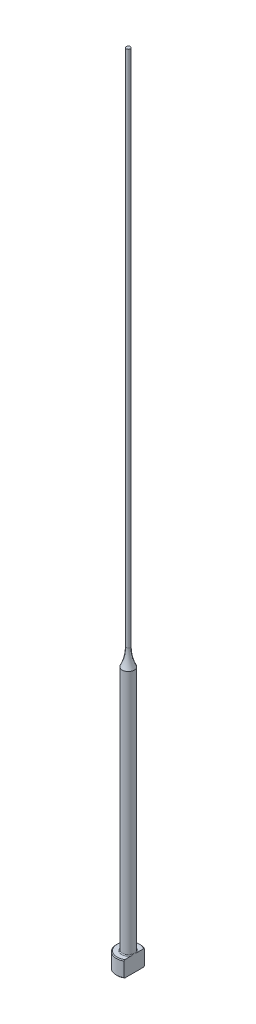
ISO-10303-21;
HEADER;
FILE_DESCRIPTION(('STEP AP214'),'2;1');
FILE_NAME('part.step','',(''),(''),'','','');
FILE_SCHEMA(('AUTOMOTIVE_DESIGN { 1 0 10303 214 1 1 1 1 }'));
ENDSEC;
DATA;
#1=APPLICATION_CONTEXT('core data for automotive mechanical design processes');
#2=APPLICATION_PROTOCOL_DEFINITION('international standard','automotive_design',2000,#1);
#3=PRODUCT_CONTEXT('',#1,'mechanical');
#4=PRODUCT('Part','Part','',(#3));
#5=PRODUCT_RELATED_PRODUCT_CATEGORY('part','',(#4));
#6=PRODUCT_DEFINITION_FORMATION('','',#4);
#7=PRODUCT_DEFINITION_CONTEXT('part definition',#1,'design');
#8=PRODUCT_DEFINITION('design','',#6,#7);
#9=PRODUCT_DEFINITION_SHAPE('','',#8);
#10=(LENGTH_UNIT() NAMED_UNIT(*) SI_UNIT(.MILLI.,.METRE.));
#11=(NAMED_UNIT(*) PLANE_ANGLE_UNIT() SI_UNIT($,.RADIAN.));
#12=(NAMED_UNIT(*) SI_UNIT($,.STERADIAN.) SOLID_ANGLE_UNIT());
#13=UNCERTAINTY_MEASURE_WITH_UNIT(LENGTH_MEASURE(1.E-05),#10,'distance_accuracy_value','');
#14=(GEOMETRIC_REPRESENTATION_CONTEXT(3) GLOBAL_UNCERTAINTY_ASSIGNED_CONTEXT((#13)) GLOBAL_UNIT_ASSIGNED_CONTEXT((#10,
#11,#12)) REPRESENTATION_CONTEXT('',''));
#15=CARTESIAN_POINT('',(0.,0.,0.));
#16=DIRECTION('',(0.,0.,1.));
#17=DIRECTION('',(1.,0.,0.));
#18=AXIS2_PLACEMENT_3D('',#15,#16,#17);
#19=CARTESIAN_POINT('',(-2.99999999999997,4.,0.));
#20=DIRECTION('',(0.,1.,0.));
#21=DIRECTION('',(0.,0.,1.));
#22=AXIS2_PLACEMENT_3D('',#19,#20,#21);
#23=PLANE('',#22);
#24=CARTESIAN_POINT('',(0.,4.,0.));
#25=DIRECTION('',(0.,1.,0.));
#26=DIRECTION('',(0.,0.,1.));
#27=AXIS2_PLACEMENT_3D('',#24,#25,#26);
#28=CIRCLE('',#27,2.79999999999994);
#29=CARTESIAN_POINT('',(1.49999999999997,4.,-2.36431808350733));
#30=VERTEX_POINT('',#29);
#31=CARTESIAN_POINT('',(1.49999999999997,4.,2.36431808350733));
#32=VERTEX_POINT('',#31);
#33=EDGE_CURVE('E187',#30,#32,#28,.T.);
#34=ORIENTED_EDGE('',*,*,#33,.T.);
#35=DIRECTION('',(0.,0.,-1.));
#36=VECTOR('',#35,1.);
#37=CARTESIAN_POINT('',(1.49999999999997,4.,0.));
#38=LINE('',#37,#36);
#39=CARTESIAN_POINT('',(1.49999999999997,3.99999999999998,0.799999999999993));
#40=VERTEX_POINT('',#39);
#41=EDGE_CURVE('E57',#32,#40,#38,.T.);
#42=ORIENTED_EDGE('',*,*,#41,.T.);
#43=CARTESIAN_POINT('',(0.,4.,0.));
#44=DIRECTION('',(0.,1.,0.));
#45=DIRECTION('',(0.,0.,1.));
#46=AXIS2_PLACEMENT_3D('',#43,#44,#45);
#47=CIRCLE('',#46,1.69999999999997);
#48=CARTESIAN_POINT('',(1.49999999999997,3.99999999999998,-0.799999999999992));
#49=VERTEX_POINT('',#48);
#50=EDGE_CURVE('E108',#40,#49,#47,.F.);
#51=ORIENTED_EDGE('',*,*,#50,.T.);
#52=EDGE_CURVE('E137',#49,#30,#38,.T.);
#53=ORIENTED_EDGE('',*,*,#52,.T.);
#54=EDGE_LOOP('',(#34,#42,#51,#53));
#55=FACE_BOUND('',#54,.T.);
#56=ADVANCED_FACE('F32',(#55),#23,.T.);
#57=CARTESIAN_POINT('',(0.,259.958771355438,0.));
#58=DIRECTION('',(0.,1.,0.));
#59=DIRECTION('',(0.,0.,1.));
#60=AXIS2_PLACEMENT_3D('',#57,#58,#59);
#61=CYLINDRICAL_SURFACE('',#60,2.99999999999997);
#62=CARTESIAN_POINT('',(0.,3.79999999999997,0.));
#63=DIRECTION('',(0.,1.,0.));
#64=DIRECTION('',(0.,0.,1.));
#65=AXIS2_PLACEMENT_3D('',#62,#63,#64);
#66=CIRCLE('',#65,2.99999999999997);
#67=CARTESIAN_POINT('',(1.49999999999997,3.79999999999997,2.5980762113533));
#68=VERTEX_POINT('',#67);
#69=CARTESIAN_POINT('',(1.49999999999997,3.79999999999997,-2.5980762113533));
#70=VERTEX_POINT('',#69);
#71=EDGE_CURVE('E105',#68,#70,#66,.F.);
#72=ORIENTED_EDGE('',*,*,#71,.T.);
#73=DIRECTION('',(0.,-1.,0.));
#74=VECTOR('',#73,1.);
#75=CARTESIAN_POINT('',(1.49999999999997,200.,-2.5980762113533));
#76=LINE('',#75,#74);
#77=CARTESIAN_POINT('',(1.49999999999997,0.200000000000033,-2.5980762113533));
#78=VERTEX_POINT('',#77);
#79=EDGE_CURVE('E193',#70,#78,#76,.T.);
#80=ORIENTED_EDGE('',*,*,#79,.T.);
#81=CARTESIAN_POINT('',(0.,0.200000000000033,0.));
#82=DIRECTION('',(0.,-1.,0.));
#83=DIRECTION('',(0.,0.,-1.));
#84=AXIS2_PLACEMENT_3D('',#81,#82,#83);
#85=CIRCLE('',#84,2.99999999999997);
#86=CARTESIAN_POINT('',(1.49999999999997,0.200000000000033,2.5980762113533));
#87=VERTEX_POINT('',#86);
#88=EDGE_CURVE('E100',#78,#87,#85,.F.);
#89=ORIENTED_EDGE('',*,*,#88,.T.);
#90=DIRECTION('',(0.,-1.,0.));
#91=VECTOR('',#90,1.);
#92=CARTESIAN_POINT('',(1.49999999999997,200.,2.5980762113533));
#93=LINE('',#92,#91);
#94=EDGE_CURVE('E93',#68,#87,#93,.T.);
#95=ORIENTED_EDGE('',*,*,#94,.F.);
#96=EDGE_LOOP('',(#72,#80,#89,#95));
#97=FACE_BOUND('',#96,.T.);
#98=ADVANCED_FACE('F158',(#97),#61,.T.);
#99=CARTESIAN_POINT('',(0.,0.,0.));
#100=DIRECTION('',(0.,-1.,0.));
#101=DIRECTION('',(0.,0.,-1.));
#102=AXIS2_PLACEMENT_3D('',#99,#100,#101);
#103=PLANE('',#102);
#104=CARTESIAN_POINT('',(0.,0.,0.));
#105=DIRECTION('',(0.,-1.,0.));
#106=DIRECTION('',(0.,0.,-1.));
#107=AXIS2_PLACEMENT_3D('',#104,#105,#106);
#108=CIRCLE('',#107,2.79999999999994);
#109=CARTESIAN_POINT('',(1.49999999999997,0.,2.36431808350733));
#110=VERTEX_POINT('',#109);
#111=CARTESIAN_POINT('',(1.49999999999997,0.,-2.36431808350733));
#112=VERTEX_POINT('',#111);
#113=EDGE_CURVE('E98',#110,#112,#108,.T.);
#114=ORIENTED_EDGE('',*,*,#113,.T.);
#115=DIRECTION('',(0.,0.,1.));
#116=VECTOR('',#115,1.);
#117=CARTESIAN_POINT('',(1.49999999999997,0.,2.5980762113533));
#118=LINE('',#117,#116);
#119=EDGE_CURVE('E83',#112,#110,#118,.T.);
#120=ORIENTED_EDGE('',*,*,#119,.T.);
#121=EDGE_LOOP('',(#114,#120));
#122=FACE_BOUND('',#121,.T.);
#123=ADVANCED_FACE('F103',(#122),#103,.T.);
#124=CARTESIAN_POINT('',(0.,4.,0.));
#125=DIRECTION('',(0.,-1.,0.));
#126=DIRECTION('',(0.,0.,-1.));
#127=AXIS2_PLACEMENT_3D('',#124,#125,#126);
#128=CONICAL_SURFACE('',#127,2.79999999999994,0.785398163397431);
#129=ORIENTED_EDGE('',*,*,#71,.F.);
#130=CARTESIAN_POINT('',(1.49999999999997,0.888258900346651,5.71827621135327));
#131=CARTESIAN_POINT('',(1.49999999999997,1.01361833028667,5.58866816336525));
#132=CARTESIAN_POINT('',(1.49999999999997,1.13884324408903,5.45892957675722));
#133=CARTESIAN_POINT('',(1.49999999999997,1.38894444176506,5.19911365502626));
#134=CARTESIAN_POINT('',(1.49999999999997,1.51382072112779,5.06903631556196));
#135=CARTESIAN_POINT('',(1.49999999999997,1.76320568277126,4.80840180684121));
#136=CARTESIAN_POINT('',(1.49999999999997,1.88771414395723,4.67784442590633));
#137=CARTESIAN_POINT('',(1.49999999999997,2.13618059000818,4.4162081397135));
#138=CARTESIAN_POINT('',(1.49999999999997,2.26013857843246,4.28512923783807));
#139=CARTESIAN_POINT('',(1.49999999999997,2.50488975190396,4.02490837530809));
#140=CARTESIAN_POINT('',(1.49999999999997,2.62569693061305,3.8957795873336));
#141=CARTESIAN_POINT('',(1.49999999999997,2.86640694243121,3.63668213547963));
#142=CARTESIAN_POINT('',(1.49999999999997,2.98630978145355,3.50671347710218));
#143=CARTESIAN_POINT('',(1.49999999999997,3.22486033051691,3.24567921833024));
#144=CARTESIAN_POINT('',(1.49999999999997,3.3435083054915,3.11461386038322));
#145=CARTESIAN_POINT('',(1.49999999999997,3.5790771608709,2.85094268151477));
#146=CARTESIAN_POINT('',(1.49999999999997,3.69599811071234,2.71833692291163));
#147=CARTESIAN_POINT('',(1.49999999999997,3.88262371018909,2.50255231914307));
#148=CARTESIAN_POINT('',(1.49999999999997,3.95312454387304,2.42006293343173));
#149=CARTESIAN_POINT('',(1.49999999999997,4.09287098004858,2.254010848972));
#150=CARTESIAN_POINT('',(1.49999999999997,4.16211645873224,2.17044804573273));
#151=CARTESIAN_POINT('',(1.49999999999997,4.29964684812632,2.00105967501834));
#152=CARTESIAN_POINT('',(1.49999999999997,4.36791386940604,1.9152195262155));
#153=CARTESIAN_POINT('',(1.49999999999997,4.50205840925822,1.7417139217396));
#154=CARTESIAN_POINT('',(1.49999999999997,4.56793649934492,1.65404891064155));
#155=CARTESIAN_POINT('',(1.49999999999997,4.69728151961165,1.47490236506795));
#156=CARTESIAN_POINT('',(1.49999999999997,4.76069661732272,1.38338308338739));
#157=CARTESIAN_POINT('',(1.49999999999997,4.88239539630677,1.19675661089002));
#158=CARTESIAN_POINT('',(1.49999999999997,4.94067201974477,1.10164473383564));
#159=CARTESIAN_POINT('',(1.49999999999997,5.048413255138,0.908008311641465));
#160=CARTESIAN_POINT('',(1.49999999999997,5.09797809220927,0.809540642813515));
#161=CARTESIAN_POINT('',(1.49999999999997,5.18432188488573,0.607192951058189));
#162=CARTESIAN_POINT('',(1.49999999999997,5.22114374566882,0.50333247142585));
#163=CARTESIAN_POINT('',(1.49999999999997,5.26099935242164,0.347577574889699));
#164=CARTESIAN_POINT('',(1.49999999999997,5.2715702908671,0.297609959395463));
#165=CARTESIAN_POINT('',(1.49999999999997,5.28794860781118,0.196885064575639));
#166=CARTESIAN_POINT('',(1.49999999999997,5.29375640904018,0.146127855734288));
#167=CARTESIAN_POINT('',(1.49999999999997,5.30019707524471,0.0444388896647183));
#168=CARTESIAN_POINT('',(1.49999999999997,5.30084594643,-0.00649183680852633));
#169=CARTESIAN_POINT('',(1.49999999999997,5.29696416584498,-0.108155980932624));
#170=CARTESIAN_POINT('',(1.49999999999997,5.29243308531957,-0.158889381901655));
#171=CARTESIAN_POINT('',(1.49999999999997,5.27856915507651,-0.259234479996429));
#172=CARTESIAN_POINT('',(1.49999999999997,5.2692782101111,-0.308852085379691));
#173=CARTESIAN_POINT('',(1.49999999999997,5.24647108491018,-0.407110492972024));
#174=CARTESIAN_POINT('',(1.49999999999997,5.23295324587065,-0.45575090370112));
#175=CARTESIAN_POINT('',(1.49999999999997,5.20226175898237,-0.55214996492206));
#176=CARTESIAN_POINT('',(1.49999999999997,5.18506801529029,-0.599902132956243));
#177=CARTESIAN_POINT('',(1.49999999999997,5.1477138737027,-0.694205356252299));
#178=CARTESIAN_POINT('',(1.49999999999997,5.12755408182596,-0.740756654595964));
#179=CARTESIAN_POINT('',(1.49999999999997,5.0632769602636,-0.879166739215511));
#180=CARTESIAN_POINT('',(1.49999999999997,5.01551721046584,-0.969329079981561));
#181=CARTESIAN_POINT('',(1.49999999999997,4.91367909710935,-1.14604316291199));
#182=CARTESIAN_POINT('',(1.49999999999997,4.85959300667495,-1.2325903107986));
#183=CARTESIAN_POINT('',(1.49999999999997,4.74697968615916,-1.40321348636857));
#184=CARTESIAN_POINT('',(1.49999999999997,4.68843573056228,-1.4872783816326));
#185=CARTESIAN_POINT('',(1.49999999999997,4.5684384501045,-1.65322187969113));
#186=CARTESIAN_POINT('',(1.49999999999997,4.50698656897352,-1.73510153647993));
#187=CARTESIAN_POINT('',(1.49999999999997,4.3811567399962,-1.89829823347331));
#188=CARTESIAN_POINT('',(1.49999999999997,4.31675092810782,-1.97959369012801));
#189=CARTESIAN_POINT('',(1.49999999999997,4.18634068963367,-2.14090082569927));
#190=CARTESIAN_POINT('',(1.49999999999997,4.12033609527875,-2.22091236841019));
#191=CARTESIAN_POINT('',(1.49999999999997,3.92086431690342,-2.45906508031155));
#192=CARTESIAN_POINT('',(1.49999999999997,3.78562663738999,-2.61572090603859));
#193=CARTESIAN_POINT('',(1.49999999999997,3.53554498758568,-2.90006295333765));
#194=CARTESIAN_POINT('',(1.49999999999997,3.42114543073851,-3.02814382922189));
#195=CARTESIAN_POINT('',(1.49999999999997,3.1909355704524,-3.28303767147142));
#196=CARTESIAN_POINT('',(1.49999999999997,3.07512522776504,-3.40985060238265));
#197=CARTESIAN_POINT('',(1.49999999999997,2.72597067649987,-3.78913849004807));
#198=CARTESIAN_POINT('',(1.49999999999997,2.49111760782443,-4.04022177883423));
#199=CARTESIAN_POINT('',(1.49999999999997,2.0288247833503,-4.52992803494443));
#200=CARTESIAN_POINT('',(1.49999999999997,1.80147747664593,-4.7686387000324));
#201=CARTESIAN_POINT('',(1.49999999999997,1.45954865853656,-5.12558036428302));
#202=CARTESIAN_POINT('',(1.49999999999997,1.34548484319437,-5.24430773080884));
#203=CARTESIAN_POINT('',(1.49999999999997,1.11707176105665,-5.48148573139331));
#204=CARTESIAN_POINT('',(1.49999999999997,1.00272249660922,-5.59993636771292));
#205=CARTESIAN_POINT('',(1.49999999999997,0.888258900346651,-5.71827621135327));
#206=B_SPLINE_CURVE_WITH_KNOTS('',3,(#130,#131,#132,#133,#134,#135,#136,#137,#138,#139,#140,
#141,#142,#143,#144,#145,#146,#147,#148,#149,#150,#151,#152,#153,#154,#155,#156,#157,#158,#159,
#160,#161,#162,#163,#164,#165,#166,#167,#168,#169,#170,#171,#172,#173,#174,#175,#176,#177,#178,
#179,#180,#181,#182,#183,#184,#185,#186,#187,#188,#189,#190,#191,#192,#193,#194,#195,#196,#197,
#198,#199,#200,#201,#202,#203,#204,#205),.UNSPECIFIED.,.F.,.F.,(4,2,2,2,2,2,2,2,2,2,2,2,2,2,2,2,
2,2,2,2,2,2,2,2,2,2,2,2,2,2,2,2,2,2,2,2,2,4),(0.,0.540943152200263,1.08189327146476,
1.62312052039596,2.16434426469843,2.69482920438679,3.22531067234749,3.75567781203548,
4.28602356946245,4.611550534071,4.9371094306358,5.26610945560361,5.59503024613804,
5.92894782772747,6.26331713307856,6.59354403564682,6.92264800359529,7.07567478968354,
7.22868799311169,7.38122626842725,7.53377717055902,7.68500755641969,7.83629736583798,
7.988436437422,8.14054446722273,8.44618799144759,8.75220879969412,9.05944044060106,
9.36652111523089,9.6776428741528,9.98879742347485,10.609592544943,11.1247803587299,
11.6399825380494,12.6713544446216,13.6603005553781,14.1542238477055,14.6481430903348),.UNSPECIFIED.);
#207=EDGE_CURVE('E136',#68,#32,#206,.T.);
#208=ORIENTED_EDGE('',*,*,#207,.T.);
#209=ORIENTED_EDGE('',*,*,#33,.F.);
#210=EDGE_CURVE('E128',#30,#70,#206,.T.);
#211=ORIENTED_EDGE('',*,*,#210,.T.);
#212=EDGE_LOOP('',(#129,#208,#209,#211));
#213=FACE_BOUND('',#212,.T.);
#214=ADVANCED_FACE('F144',(#213),#128,.T.);
#215=CARTESIAN_POINT('',(0.,0.200000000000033,0.));
#216=DIRECTION('',(0.,1.,0.));
#217=DIRECTION('',(0.,0.,1.));
#218=AXIS2_PLACEMENT_3D('',#215,#216,#217);
#219=CONICAL_SURFACE('',#218,2.99999999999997,0.785398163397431);
#220=ORIENTED_EDGE('',*,*,#88,.F.);
#221=CARTESIAN_POINT('',(1.49999999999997,3.11174109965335,-5.71827621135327));
#222=CARTESIAN_POINT('',(1.49999999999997,2.98638166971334,-5.58866816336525));
#223=CARTESIAN_POINT('',(1.49999999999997,2.86115675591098,-5.45892957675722));
#224=CARTESIAN_POINT('',(1.49999999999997,2.61105555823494,-5.19911365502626));
#225=CARTESIAN_POINT('',(1.49999999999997,2.48617927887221,-5.06903631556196));
#226=CARTESIAN_POINT('',(1.49999999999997,2.23679431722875,-4.80840180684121));
#227=CARTESIAN_POINT('',(1.49999999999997,2.11228585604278,-4.67784442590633));
#228=CARTESIAN_POINT('',(1.49999999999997,1.86381940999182,-4.4162081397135));
#229=CARTESIAN_POINT('',(1.49999999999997,1.73986142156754,-4.28512923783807));
#230=CARTESIAN_POINT('',(1.49999999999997,1.49511024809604,-4.02490837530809));
#231=CARTESIAN_POINT('',(1.49999999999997,1.37430306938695,-3.8957795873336));
#232=CARTESIAN_POINT('',(1.49999999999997,1.13359305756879,-3.63668213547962));
#233=CARTESIAN_POINT('',(1.49999999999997,1.01369021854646,-3.50671347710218));
#234=CARTESIAN_POINT('',(1.49999999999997,0.775139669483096,-3.24567921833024));
#235=CARTESIAN_POINT('',(1.49999999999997,0.656491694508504,-3.11461386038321));
#236=CARTESIAN_POINT('',(1.49999999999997,0.420922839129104,-2.85094268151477));
#237=CARTESIAN_POINT('',(1.49999999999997,0.304001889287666,-2.71833692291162));
#238=CARTESIAN_POINT('',(1.49999999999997,0.117376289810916,-2.50255231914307));
#239=CARTESIAN_POINT('',(1.49999999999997,0.0468754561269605,-2.42006293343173));
#240=CARTESIAN_POINT('',(1.49999999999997,-0.0928709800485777,-2.254010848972));
#241=CARTESIAN_POINT('',(1.49999999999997,-0.162116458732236,-2.17044804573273));
#242=CARTESIAN_POINT('',(1.49999999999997,-0.299646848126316,-2.00105967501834));
#243=CARTESIAN_POINT('',(1.49999999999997,-0.367913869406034,-1.9152195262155));
#244=CARTESIAN_POINT('',(1.49999999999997,-0.502058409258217,-1.7417139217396));
#245=CARTESIAN_POINT('',(1.49999999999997,-0.567936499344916,-1.65404891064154));
#246=CARTESIAN_POINT('',(1.49999999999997,-0.697281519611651,-1.47490236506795));
#247=CARTESIAN_POINT('',(1.49999999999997,-0.760696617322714,-1.38338308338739));
#248=CARTESIAN_POINT('',(1.49999999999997,-0.882395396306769,-1.19675661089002));
#249=CARTESIAN_POINT('',(1.49999999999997,-0.940672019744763,-1.10164473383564));
#250=CARTESIAN_POINT('',(1.49999999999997,-1.048413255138,-0.908008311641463));
#251=CARTESIAN_POINT('',(1.49999999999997,-1.09797809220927,-0.809540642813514));
#252=CARTESIAN_POINT('',(1.49999999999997,-1.18432188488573,-0.607192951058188));
#253=CARTESIAN_POINT('',(1.49999999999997,-1.22114374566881,-0.503332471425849));
#254=CARTESIAN_POINT('',(1.49999999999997,-1.26099935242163,-0.347577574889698));
#255=CARTESIAN_POINT('',(1.49999999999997,-1.2715702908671,-0.297609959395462));
#256=CARTESIAN_POINT('',(1.49999999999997,-1.28794860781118,-0.196885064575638));
#257=CARTESIAN_POINT('',(1.49999999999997,-1.29375640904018,-0.146127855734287));
#258=CARTESIAN_POINT('',(1.49999999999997,-1.30019707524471,-0.0444388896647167));
#259=CARTESIAN_POINT('',(1.49999999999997,-1.30084594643,0.00649183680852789));
#260=CARTESIAN_POINT('',(1.49999999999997,-1.29696416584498,0.108155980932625));
#261=CARTESIAN_POINT('',(1.49999999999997,-1.29243308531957,0.158889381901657));
#262=CARTESIAN_POINT('',(1.49999999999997,-1.2785691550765,0.259234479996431));
#263=CARTESIAN_POINT('',(1.49999999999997,-1.2692782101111,0.308852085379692));
#264=CARTESIAN_POINT('',(1.49999999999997,-1.24647108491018,0.407110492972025));
#265=CARTESIAN_POINT('',(1.49999999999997,-1.23295324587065,0.455750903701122));
#266=CARTESIAN_POINT('',(1.49999999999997,-1.20226175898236,0.552149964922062));
#267=CARTESIAN_POINT('',(1.49999999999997,-1.18506801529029,0.599902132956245));
#268=CARTESIAN_POINT('',(1.49999999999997,-1.14771387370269,0.694205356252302));
#269=CARTESIAN_POINT('',(1.49999999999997,-1.12755408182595,0.740756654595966));
#270=CARTESIAN_POINT('',(1.49999999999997,-1.0632769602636,0.879166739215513));
#271=CARTESIAN_POINT('',(1.49999999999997,-1.01551721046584,0.969329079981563));
#272=CARTESIAN_POINT('',(1.49999999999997,-0.913679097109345,1.14604316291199));
#273=CARTESIAN_POINT('',(1.49999999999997,-0.859593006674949,1.2325903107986));
#274=CARTESIAN_POINT('',(1.49999999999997,-0.746979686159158,1.40321348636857));
#275=CARTESIAN_POINT('',(1.49999999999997,-0.688435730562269,1.4872783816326));
#276=CARTESIAN_POINT('',(1.49999999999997,-0.568438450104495,1.65322187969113));
#277=CARTESIAN_POINT('',(1.49999999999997,-0.506986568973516,1.73510153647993));
#278=CARTESIAN_POINT('',(1.49999999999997,-0.381156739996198,1.89829823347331));
#279=CARTESIAN_POINT('',(1.49999999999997,-0.316750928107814,1.97959369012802));
#280=CARTESIAN_POINT('',(1.49999999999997,-0.186340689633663,2.14090082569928));
#281=CARTESIAN_POINT('',(1.49999999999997,-0.12033609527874,2.22091236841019));
#282=CARTESIAN_POINT('',(1.49999999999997,0.0791356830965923,2.45906508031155));
#283=CARTESIAN_POINT('',(1.49999999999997,0.214373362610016,2.61572090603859));
#284=CARTESIAN_POINT('',(1.49999999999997,0.46445501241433,2.90006295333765));
#285=CARTESIAN_POINT('',(1.49999999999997,0.578854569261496,3.02814382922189));
#286=CARTESIAN_POINT('',(1.49999999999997,0.809064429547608,3.28303767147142));
#287=CARTESIAN_POINT('',(1.49999999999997,0.924874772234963,3.40985060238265));
#288=CARTESIAN_POINT('',(1.49999999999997,1.27402932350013,3.78913849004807));
#289=CARTESIAN_POINT('',(1.49999999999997,1.50888239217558,4.04022177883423));
#290=CARTESIAN_POINT('',(1.49999999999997,1.97117521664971,4.52992803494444));
#291=CARTESIAN_POINT('',(1.49999999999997,2.19852252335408,4.76863870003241));
#292=CARTESIAN_POINT('',(1.49999999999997,2.54045134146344,5.12558036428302));
#293=CARTESIAN_POINT('',(1.49999999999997,2.65451515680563,5.24430773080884));
#294=CARTESIAN_POINT('',(1.49999999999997,2.88292823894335,5.48148573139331));
#295=CARTESIAN_POINT('',(1.49999999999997,2.99727750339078,5.59993636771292));
#296=CARTESIAN_POINT('',(1.49999999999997,3.11174109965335,5.71827621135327));
#297=B_SPLINE_CURVE_WITH_KNOTS('',3,(#221,#222,#223,#224,#225,#226,#227,#228,#229,#230,#231,
#232,#233,#234,#235,#236,#237,#238,#239,#240,#241,#242,#243,#244,#245,#246,#247,#248,#249,#250,
#251,#252,#253,#254,#255,#256,#257,#258,#259,#260,#261,#262,#263,#264,#265,#266,#267,#268,#269,
#270,#271,#272,#273,#274,#275,#276,#277,#278,#279,#280,#281,#282,#283,#284,#285,#286,#287,#288,
#289,#290,#291,#292,#293,#294,#295,#296),.UNSPECIFIED.,.F.,.F.,(4,2,2,2,2,2,2,2,2,2,2,2,2,2,2,2,
2,2,2,2,2,2,2,2,2,2,2,2,2,2,2,2,2,2,2,2,2,4),(0.,0.540943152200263,1.08189327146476,
1.62312052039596,2.16434426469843,2.69482920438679,3.22531067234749,3.75567781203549,
4.28602356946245,4.611550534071,4.9371094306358,5.26610945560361,5.59503024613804,
5.92894782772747,6.26331713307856,6.59354403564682,6.92264800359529,7.07567478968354,
7.2286879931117,7.38122626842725,7.53377717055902,7.6850075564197,7.83629736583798,
7.98843643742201,8.14054446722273,8.44618799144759,8.75220879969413,9.05944044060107,
9.3665211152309,9.6776428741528,9.98879742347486,10.609592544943,11.1247803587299,
11.6399825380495,12.6713544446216,13.6603005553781,14.1542238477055,14.6481430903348),.UNSPECIFIED.);
#298=EDGE_CURVE('E86',#78,#112,#297,.T.);
#299=ORIENTED_EDGE('',*,*,#298,.T.);
#300=ORIENTED_EDGE('',*,*,#113,.F.);
#301=EDGE_CURVE('E89',#110,#87,#297,.T.);
#302=ORIENTED_EDGE('',*,*,#301,.T.);
#303=EDGE_LOOP('',(#220,#299,#300,#302));
#304=FACE_BOUND('',#303,.T.);
#305=ADVANCED_FACE('F97',(#304),#219,.T.);
#306=CARTESIAN_POINT('',(0.,4.19999999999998,0.));
#307=DIRECTION('',(0.,1.,0.));
#308=DIRECTION('',(0.,0.,1.));
#309=AXIS2_PLACEMENT_3D('',#306,#307,#308);
#310=TOROIDAL_SURFACE('',#309,1.69999999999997,0.2);
#311=CARTESIAN_POINT('',(1.49999999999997,4.19999999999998,0.));
#312=CARTESIAN_POINT('',(1.49999999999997,4.20000050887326,7.14686674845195E-11));
#313=CARTESIAN_POINT('',(1.49999999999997,4.20000101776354,-1.21663673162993E-07));
#314=CARTESIAN_POINT('',(1.49999999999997,4.20000199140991,-4.97616237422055E-07));
#315=CARTESIAN_POINT('',(1.49999999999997,4.20000245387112,-7.56516220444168E-07));
#316=CARTESIAN_POINT('',(1.49999999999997,4.20000338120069,-1.37642837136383E-06));
#317=CARTESIAN_POINT('',(1.49999999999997,4.20000384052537,-1.74563476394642E-06));
#318=CARTESIAN_POINT('',(1.49999999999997,4.20000469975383,-2.53565984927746E-06));
#319=CARTESIAN_POINT('',(1.49999999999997,4.20000510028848,-2.95582597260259E-06));
#320=CARTESIAN_POINT('',(1.49999999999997,4.20000646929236,-4.48430445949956E-06));
#321=CARTESIAN_POINT('',(1.49999999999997,4.20000736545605,-5.6586103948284E-06));
#322=CARTESIAN_POINT('',(1.49999999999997,4.20000893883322,-8.06479202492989E-06));
#323=CARTESIAN_POINT('',(1.49999999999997,4.20000962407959,-9.29170517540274E-06));
#324=CARTESIAN_POINT('',(1.49999999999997,4.20001225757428,-1.416232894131E-05));
#325=CARTESIAN_POINT('',(1.49999999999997,4.20001407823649,-1.78790031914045E-05));
#326=CARTESIAN_POINT('',(1.49999999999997,4.20001699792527,-2.51443066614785E-05));
#327=CARTESIAN_POINT('',(1.49999999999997,4.20001815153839,-2.86715394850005E-05));
#328=CARTESIAN_POINT('',(1.49999999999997,4.20002315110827,-4.39218128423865E-05));
#329=CARTESIAN_POINT('',(1.49999999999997,4.20002701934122,-5.56288390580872E-05));
#330=CARTESIAN_POINT('',(1.49999999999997,4.20003312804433,-7.7405829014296E-05));
#331=CARTESIAN_POINT('',(1.49999999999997,4.20003553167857,-8.74278412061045E-05));
#332=CARTESIAN_POINT('',(1.49999999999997,4.20005483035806,-0.000161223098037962));
#333=CARTESIAN_POINT('',(1.49999999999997,4.20007979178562,-0.000222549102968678));
#334=CARTESIAN_POINT('',(1.49999999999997,4.20017391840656,-0.000462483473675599));
#335=CARTESIAN_POINT('',(1.49999999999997,4.20023706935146,-0.000642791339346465));
#336=CARTESIAN_POINT('',(1.49999999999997,4.20048761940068,-0.00134785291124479));
#337=CARTESIAN_POINT('',(1.49999999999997,4.20068132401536,-0.00187087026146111));
#338=CARTESIAN_POINT('',(1.49999999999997,4.20147357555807,-0.00402004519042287));
#339=CARTESIAN_POINT('',(1.49999999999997,4.20206499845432,-0.0056481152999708));
#340=CARTESIAN_POINT('',(1.49999999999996,4.20892634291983,-0.0245232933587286));
#341=CARTESIAN_POINT('',(1.49999999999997,4.21523683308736,-0.041759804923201));
#342=CARTESIAN_POINT('',(1.49999999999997,4.22755028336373,-0.0756091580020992));
#343=CARTESIAN_POINT('',(1.49999999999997,4.23355589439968,-0.0922211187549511));
#344=CARTESIAN_POINT('',(1.49999999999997,4.24620101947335,-0.127454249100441));
#345=CARTESIAN_POINT('',(1.49999999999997,4.25283080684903,-0.146078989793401));
#346=CARTESIAN_POINT('',(1.49999999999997,4.26599765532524,-0.183577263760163));
#347=CARTESIAN_POINT('',(1.49999999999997,4.27253305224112,-0.202451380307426));
#348=CARTESIAN_POINT('',(1.49999999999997,4.28834228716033,-0.248982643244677));
#349=CARTESIAN_POINT('',(1.49999999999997,4.2974915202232,-0.276682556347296));
#350=CARTESIAN_POINT('',(1.49999999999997,4.31490935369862,-0.331625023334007));
#351=CARTESIAN_POINT('',(1.49999999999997,4.3231938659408,-0.358862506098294));
#352=CARTESIAN_POINT('',(1.49999999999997,4.34051594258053,-0.419125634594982));
#353=CARTESIAN_POINT('',(1.49999999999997,4.34936607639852,-0.452206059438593));
#354=CARTESIAN_POINT('',(1.49999999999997,4.36549583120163,-0.519023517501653));
#355=CARTESIAN_POINT('',(1.49999999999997,4.37276283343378,-0.552763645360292));
#356=CARTESIAN_POINT('',(1.49999999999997,4.38554755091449,-0.62305310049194));
#357=CARTESIAN_POINT('',(1.49999999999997,4.39090573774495,-0.65963271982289));
#358=CARTESIAN_POINT('',(1.49999999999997,4.39825016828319,-0.733028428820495));
#359=CARTESIAN_POINT('',(1.49999999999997,4.40024734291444,-0.76984335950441));
#360=CARTESIAN_POINT('',(1.49999999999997,4.39970780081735,-0.842856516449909));
#361=CARTESIAN_POINT('',(1.49999999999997,4.39725347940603,-0.879053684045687));
#362=CARTESIAN_POINT('',(1.49999999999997,4.38900085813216,-0.93238076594));
#363=CARTESIAN_POINT('',(1.49999999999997,4.38553049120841,-0.949868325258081));
#364=CARTESIAN_POINT('',(1.49999999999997,4.37678336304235,-0.984374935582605));
#365=CARTESIAN_POINT('',(1.49999999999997,4.37150943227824,-1.00139467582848));
#366=CARTESIAN_POINT('',(1.49999999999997,4.35869781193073,-1.03479423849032));
#367=CARTESIAN_POINT('',(1.49999999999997,4.3511359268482,-1.05116499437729));
#368=CARTESIAN_POINT('',(1.49999999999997,4.33325333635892,-1.08234828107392));
#369=CARTESIAN_POINT('',(1.49999999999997,4.32294266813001,-1.09716621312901));
#370=CARTESIAN_POINT('',(1.49999999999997,4.30512758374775,-1.11714173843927));
#371=CARTESIAN_POINT('',(1.49999999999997,4.29884721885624,-1.12339066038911));
#372=CARTESIAN_POINT('',(1.49999999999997,4.28545950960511,-1.13494695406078));
#373=CARTESIAN_POINT('',(1.49999999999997,4.27835226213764,-1.14025443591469));
#374=CARTESIAN_POINT('',(1.49999999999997,4.26325970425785,-1.14967631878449));
#375=CARTESIAN_POINT('',(1.49999999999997,4.25526534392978,-1.15377649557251));
#376=CARTESIAN_POINT('',(1.49999999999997,4.23863207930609,-1.16034952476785));
#377=CARTESIAN_POINT('',(1.49999999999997,4.22999427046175,-1.16282507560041));
#378=CARTESIAN_POINT('',(1.49999999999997,4.21343922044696,-1.16570267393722));
#379=CARTESIAN_POINT('',(1.49999999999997,4.20555896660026,-1.16631687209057));
#380=CARTESIAN_POINT('',(1.49999999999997,4.18982775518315,-1.16602054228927));
#381=CARTESIAN_POINT('',(1.49999999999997,4.18197679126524,-1.16511036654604));
#382=CARTESIAN_POINT('',(1.49999999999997,4.16747846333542,-1.16204446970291));
#383=CARTESIAN_POINT('',(1.49999999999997,4.16079696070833,-1.16004509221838));
#384=CARTESIAN_POINT('',(1.49999999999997,4.14781700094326,-1.15505972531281));
#385=CARTESIAN_POINT('',(1.49999999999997,4.14151862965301,-1.1520735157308));
#386=CARTESIAN_POINT('',(1.49999999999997,4.12690214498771,-1.14387585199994));
#387=CARTESIAN_POINT('',(1.49999999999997,4.11881436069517,-1.13825400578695));
#388=CARTESIAN_POINT('',(1.49999999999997,4.1036444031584,-1.12578441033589));
#389=CARTESIAN_POINT('',(1.49999999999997,4.09656475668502,-1.11893367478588));
#390=CARTESIAN_POINT('',(1.49999999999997,4.08012297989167,-1.10074342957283));
#391=CARTESIAN_POINT('',(1.49999999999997,4.07136543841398,-1.08886044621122));
#392=CARTESIAN_POINT('',(1.49999999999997,4.05578194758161,-1.06392743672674));
#393=CARTESIAN_POINT('',(1.49999999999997,4.0489571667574,-1.05087671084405));
#394=CARTESIAN_POINT('',(1.49999999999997,4.03273856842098,-1.01472307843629));
#395=CARTESIAN_POINT('',(1.49999999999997,4.02486230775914,-0.990945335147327));
#396=CARTESIAN_POINT('',(1.49999999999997,4.01257693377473,-0.94232199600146));
#397=CARTESIAN_POINT('',(1.49999999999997,4.00820590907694,-0.917467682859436));
#398=CARTESIAN_POINT('',(1.49999999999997,4.00229956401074,-0.867912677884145));
#399=CARTESIAN_POINT('',(1.49999999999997,4.0007128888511,-0.843217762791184));
#400=CARTESIAN_POINT('',(1.49999999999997,3.9996723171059,-0.79374605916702));
#401=CARTESIAN_POINT('',(1.49999999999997,4.0002230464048,-0.768969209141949));
#402=CARTESIAN_POINT('',(1.49999999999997,4.00433101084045,-0.696994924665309));
#403=CARTESIAN_POINT('',(1.49999999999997,4.01016976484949,-0.64993124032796));
#404=CARTESIAN_POINT('',(1.49999999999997,4.02567776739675,-0.559166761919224));
#405=CARTESIAN_POINT('',(1.49999999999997,4.03511950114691,-0.515423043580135));
#406=CARTESIAN_POINT('',(1.49999999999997,4.05693059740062,-0.427590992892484));
#407=CARTESIAN_POINT('',(1.49999999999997,4.06936356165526,-0.383518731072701));
#408=CARTESIAN_POINT('',(1.49999999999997,4.09174953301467,-0.310161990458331));
#409=CARTESIAN_POINT('',(1.49999999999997,4.10119843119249,-0.280718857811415));
#410=CARTESIAN_POINT('',(1.49999999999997,4.12060442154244,-0.22234098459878));
#411=CARTESIAN_POINT('',(1.49999999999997,4.13055519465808,-0.193404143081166));
#412=CARTESIAN_POINT('',(1.49999999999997,4.14973721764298,-0.138756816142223));
#413=CARTESIAN_POINT('',(1.49999999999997,4.15893123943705,-0.113033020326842));
#414=CARTESIAN_POINT('',(1.49999999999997,4.17788037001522,-0.0606351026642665));
#415=CARTESIAN_POINT('',(1.49999999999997,4.18764328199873,-0.0339636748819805));
#416=CARTESIAN_POINT('',(1.49999999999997,4.19793548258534,-0.00564657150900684));
#417=CARTESIAN_POINT('',(1.49999999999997,4.19852751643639,-0.00401699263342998));
#418=CARTESIAN_POINT('',(1.49999999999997,4.1993199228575,-0.0018674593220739));
#419=CARTESIAN_POINT('',(1.49999999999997,4.19951319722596,-0.00134559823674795));
#420=CARTESIAN_POINT('',(1.49999999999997,4.19976322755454,-0.000641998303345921));
#421=CARTESIAN_POINT('',(1.49999999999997,4.19982627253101,-0.000461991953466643));
#422=CARTESIAN_POINT('',(1.49999999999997,4.19992025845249,-0.000222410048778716));
#423=CARTESIAN_POINT('',(1.49999999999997,4.19994519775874,-0.000161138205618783));
#424=CARTESIAN_POINT('',(1.49999999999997,4.19996448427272,-8.74039267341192E-05));
#425=CARTESIAN_POINT('',(1.49999999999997,4.19996688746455,-7.73857556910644E-05));
#426=CARTESIAN_POINT('',(1.49999999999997,4.1999729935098,-5.56173272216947E-05));
#427=CARTESIAN_POINT('',(1.49999999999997,4.19997685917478,-4.39149186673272E-05));
#428=CARTESIAN_POINT('',(1.49999999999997,4.19998185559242,-2.86698156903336E-05));
#429=CARTESIAN_POINT('',(1.49999999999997,4.19998300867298,-2.51431575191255E-05));
#430=CARTESIAN_POINT('',(1.49999999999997,4.19998592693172,-1.78789552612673E-05));
#431=CARTESIAN_POINT('',(1.49999999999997,4.19998774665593,-1.41627846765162E-05));
#432=CARTESIAN_POINT('',(1.49999999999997,4.19999037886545,-9.29264488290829E-06));
#433=CARTESIAN_POINT('',(1.49999999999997,4.19999106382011,-8.06577599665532E-06));
#434=CARTESIAN_POINT('',(1.49999999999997,4.19999263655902,-5.65962639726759E-06));
#435=CARTESIAN_POINT('',(1.49999999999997,4.19999353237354,-4.48530466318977E-06));
#436=CARTESIAN_POINT('',(1.49999999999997,4.19999490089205,-2.95673740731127E-06));
#437=CARTESIAN_POINT('',(1.49999999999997,4.1999953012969,-2.53653208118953E-06));
#438=CARTESIAN_POINT('',(1.49999999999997,4.19999616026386,-1.74640525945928E-06));
#439=CARTESIAN_POINT('',(1.49999999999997,4.19999661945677,-1.37713598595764E-06));
#440=CARTESIAN_POINT('',(1.49999999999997,4.19999754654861,-7.57072336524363E-07));
#441=CARTESIAN_POINT('',(1.49999999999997,4.19999800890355,-4.9808738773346E-07));
#442=CARTESIAN_POINT('',(1.49999999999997,4.19999898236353,-1.21927249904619E-07));
#443=CARTESIAN_POINT('',(1.49999999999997,4.19999949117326,-7.14621294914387E-11));
#444=CARTESIAN_POINT('',(1.49999999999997,4.19999999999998,0.));
#445=B_SPLINE_CURVE_WITH_KNOTS('',3,(#311,#312,#313,#314,#315,#316,#317,#318,#319,#320,#321,
#322,#323,#324,#325,#326,#327,#328,#329,#330,#331,#332,#333,#334,#335,#336,#337,#338,#339,#340,
#341,#342,#343,#344,#345,#346,#347,#348,#349,#350,#351,#352,#353,#354,#355,#356,#357,#358,#359,
#360,#361,#362,#363,#364,#365,#366,#367,#368,#369,#370,#371,#372,#373,#374,#375,#376,#377,#378,
#379,#380,#381,#382,#383,#384,#385,#386,#387,#388,#389,#390,#391,#392,#393,#394,#395,#396,#397,
#398,#399,#400,#401,#402,#403,#404,#405,#406,#407,#408,#409,#410,#411,#412,#413,#414,#415,#416,
#417,#418,#419,#420,#421,#422,#423,#424,#425,#426,#427,#428,#429,#430,#431,#432,#433,#434,#435,
#436,#437,#438,#439,#440,#441,#442,#443,#444),.UNSPECIFIED.,.T.,.F.,(4,2,2,2,2,2,2,2,2,2,2,2,2,
2,2,2,2,2,2,2,2,2,2,2,2,2,2,2,2,2,2,2,2,2,2,2,2,2,2,2,2,2,2,2,2,2,2,2,2,2,2,2,2,2,2,2,2,2,2,2,2,
2,2,2,2,2,4),(0.,1.5268750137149E-06,3.10959387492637E-06,4.86976756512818E-06,
6.60940084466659E-06,1.10202525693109E-05,1.5232779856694E-05,2.7614037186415E-05,
3.87351645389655E-05,7.57188332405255E-05,0.000106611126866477,0.000304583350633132,
0.00087827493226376,0.00255078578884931,0.0077480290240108,0.0628090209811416,0.115802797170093,
0.175110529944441,0.23503061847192,0.32253950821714,0.407938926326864,0.510638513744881,
0.614128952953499,0.724918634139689,0.835347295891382,0.943752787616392,0.997165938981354,
1.05049564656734,1.10441029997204,1.15813071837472,1.18463966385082,1.21114550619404,
1.23795217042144,1.26471419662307,1.2882832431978,1.31184684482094,1.33268332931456,
1.35352446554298,1.38290826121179,1.41236445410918,1.45639976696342,1.50046164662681,
1.57518788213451,1.65071550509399,1.72483484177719,1.79911468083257,1.94105061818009,
2.07520625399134,2.2125154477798,2.30527614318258,2.39707056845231,2.47902409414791,
2.56422207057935,2.56942417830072,2.57109299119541,2.57166572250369,2.57186352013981,
2.57189440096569,2.57193136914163,2.57194248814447,2.57195486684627,2.57195907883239,
2.57196348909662,2.57196522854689,2.57196698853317,2.57196857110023,2.57197009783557),.UNSPECIFIED.);
#446=CARTESIAN_POINT('',(1.49999999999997,4.19999999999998,0.));
#447=VERTEX_POINT('',#446);
#448=EDGE_CURVE('E11',#49,#447,#445,.T.);
#449=ORIENTED_EDGE('',*,*,#448,.F.);
#450=ORIENTED_EDGE('',*,*,#50,.F.);
#451=CARTESIAN_POINT('',(1.49999999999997,4.19999999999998,0.));
#452=CARTESIAN_POINT('',(1.49999999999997,4.1999994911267,-7.1468641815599E-11));
#453=CARTESIAN_POINT('',(1.49999999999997,4.19999898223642,1.21663673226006E-07));
#454=CARTESIAN_POINT('',(1.49999999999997,4.19999800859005,4.97616237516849E-07));
#455=CARTESIAN_POINT('',(1.49999999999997,4.19999754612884,7.56516220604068E-07));
#456=CARTESIAN_POINT('',(1.49999999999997,4.19999661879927,1.37642837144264E-06));
#457=CARTESIAN_POINT('',(1.49999999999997,4.1999961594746,1.74563476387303E-06));
#458=CARTESIAN_POINT('',(1.49999999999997,4.19999530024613,2.5356598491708E-06));
#459=CARTESIAN_POINT('',(1.49999999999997,4.19999489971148,2.95582597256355E-06));
#460=CARTESIAN_POINT('',(1.49999999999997,4.1999935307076,4.48430445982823E-06));
#461=CARTESIAN_POINT('',(1.49999999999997,4.19999263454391,5.6586103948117E-06));
#462=CARTESIAN_POINT('',(1.49999999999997,4.19999106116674,8.06479202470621E-06));
#463=CARTESIAN_POINT('',(1.49999999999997,4.19999037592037,9.29170517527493E-06));
#464=CARTESIAN_POINT('',(1.49999999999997,4.19998774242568,1.41623289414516E-05));
#465=CARTESIAN_POINT('',(1.49999999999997,4.19998592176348,1.78790031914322E-05));
#466=CARTESIAN_POINT('',(1.49999999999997,4.1999830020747,2.51443066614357E-05));
#467=CARTESIAN_POINT('',(1.49999999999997,4.19998184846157,2.86715394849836E-05));
#468=CARTESIAN_POINT('',(1.49999999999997,4.1999768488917,4.39218128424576E-05));
#469=CARTESIAN_POINT('',(1.49999999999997,4.19997298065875,5.56288390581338E-05));
#470=CARTESIAN_POINT('',(1.49999999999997,4.19996687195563,7.7405829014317E-05));
#471=CARTESIAN_POINT('',(1.49999999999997,4.19996446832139,8.74278412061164E-05));
#472=CARTESIAN_POINT('',(1.49999999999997,4.1999451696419,0.000161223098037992));
#473=CARTESIAN_POINT('',(1.49999999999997,4.19992020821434,0.000222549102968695));
#474=CARTESIAN_POINT('',(1.49999999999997,4.19982608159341,0.000462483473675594));
#475=CARTESIAN_POINT('',(1.49999999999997,4.1997629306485,0.000642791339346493));
#476=CARTESIAN_POINT('',(1.49999999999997,4.19951238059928,0.00134785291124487));
#477=CARTESIAN_POINT('',(1.49999999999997,4.19931867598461,0.00187087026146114));
#478=CARTESIAN_POINT('',(1.49999999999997,4.19852642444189,0.00402004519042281));
#479=CARTESIAN_POINT('',(1.49999999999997,4.19793500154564,0.00564811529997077));
#480=CARTESIAN_POINT('',(1.49999999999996,4.19107365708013,0.0245232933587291));
#481=CARTESIAN_POINT('',(1.49999999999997,4.1847631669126,0.0417598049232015));
#482=CARTESIAN_POINT('',(1.49999999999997,4.17244971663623,0.0756091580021));
#483=CARTESIAN_POINT('',(1.49999999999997,4.16644410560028,0.0922211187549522));
#484=CARTESIAN_POINT('',(1.49999999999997,4.15379898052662,0.127454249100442));
#485=CARTESIAN_POINT('',(1.49999999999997,4.14716919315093,0.146078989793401));
#486=CARTESIAN_POINT('',(1.49999999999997,4.13400234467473,0.183577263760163));
#487=CARTESIAN_POINT('',(1.49999999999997,4.12746694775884,0.202451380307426));
#488=CARTESIAN_POINT('',(1.49999999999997,4.11165771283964,0.248982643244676));
#489=CARTESIAN_POINT('',(1.49999999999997,4.10250847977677,0.276682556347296));
#490=CARTESIAN_POINT('',(1.49999999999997,4.08509064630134,0.331625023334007));
#491=CARTESIAN_POINT('',(1.49999999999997,4.07680613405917,0.358862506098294));
#492=CARTESIAN_POINT('',(1.49999999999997,4.05948405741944,0.419125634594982));
#493=CARTESIAN_POINT('',(1.49999999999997,4.05063392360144,0.452206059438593));
#494=CARTESIAN_POINT('',(1.49999999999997,4.03450416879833,0.519023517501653));
#495=CARTESIAN_POINT('',(1.49999999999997,4.02723716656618,0.552763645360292));
#496=CARTESIAN_POINT('',(1.49999999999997,4.01445244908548,0.62305310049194));
#497=CARTESIAN_POINT('',(1.49999999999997,4.00909426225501,0.659632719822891));
#498=CARTESIAN_POINT('',(1.49999999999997,4.00174983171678,0.733028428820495));
#499=CARTESIAN_POINT('',(1.49999999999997,3.99975265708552,0.76984335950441));
#500=CARTESIAN_POINT('',(1.49999999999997,4.00029219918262,0.842856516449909));
#501=CARTESIAN_POINT('',(1.49999999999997,4.00274652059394,0.879053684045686));
#502=CARTESIAN_POINT('',(1.49999999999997,4.0109991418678,0.93238076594));
#503=CARTESIAN_POINT('',(1.49999999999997,4.01446950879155,0.949868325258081));
#504=CARTESIAN_POINT('',(1.49999999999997,4.02321663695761,0.984374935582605));
#505=CARTESIAN_POINT('',(1.49999999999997,4.02849056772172,1.00139467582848));
#506=CARTESIAN_POINT('',(1.49999999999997,4.04130218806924,1.03479423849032));
#507=CARTESIAN_POINT('',(1.49999999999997,4.04886407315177,1.05116499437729));
#508=CARTESIAN_POINT('',(1.49999999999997,4.06674666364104,1.08234828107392));
#509=CARTESIAN_POINT('',(1.49999999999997,4.07705733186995,1.09716621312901));
#510=CARTESIAN_POINT('',(1.49999999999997,4.09487241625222,1.11714173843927));
#511=CARTESIAN_POINT('',(1.49999999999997,4.10115278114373,1.12339066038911));
#512=CARTESIAN_POINT('',(1.49999999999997,4.11454049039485,1.13494695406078));
#513=CARTESIAN_POINT('',(1.49999999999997,4.12164773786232,1.14025443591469));
#514=CARTESIAN_POINT('',(1.49999999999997,4.13674029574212,1.14967631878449));
#515=CARTESIAN_POINT('',(1.49999999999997,4.14473465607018,1.15377649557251));
#516=CARTESIAN_POINT('',(1.49999999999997,4.16136792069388,1.16034952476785));
#517=CARTESIAN_POINT('',(1.49999999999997,4.17000572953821,1.16282507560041));
#518=CARTESIAN_POINT('',(1.49999999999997,4.186560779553,1.16570267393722));
#519=CARTESIAN_POINT('',(1.49999999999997,4.1944410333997,1.16631687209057));
#520=CARTESIAN_POINT('',(1.49999999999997,4.21017224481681,1.16602054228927));
#521=CARTESIAN_POINT('',(1.49999999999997,4.21802320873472,1.16511036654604));
#522=CARTESIAN_POINT('',(1.49999999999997,4.23252153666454,1.16204446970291));
#523=CARTESIAN_POINT('',(1.49999999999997,4.23920303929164,1.16004509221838));
#524=CARTESIAN_POINT('',(1.49999999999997,4.2521829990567,1.15505972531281));
#525=CARTESIAN_POINT('',(1.49999999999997,4.25848137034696,1.1520735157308));
#526=CARTESIAN_POINT('',(1.49999999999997,4.27309785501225,1.14387585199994));
#527=CARTESIAN_POINT('',(1.49999999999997,4.28118563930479,1.13825400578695));
#528=CARTESIAN_POINT('',(1.49999999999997,4.29635559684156,1.12578441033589));
#529=CARTESIAN_POINT('',(1.49999999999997,4.30343524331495,1.11893367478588));
#530=CARTESIAN_POINT('',(1.49999999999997,4.31987702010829,1.10074342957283));
#531=CARTESIAN_POINT('',(1.49999999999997,4.32863456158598,1.08886044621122));
#532=CARTESIAN_POINT('',(1.49999999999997,4.34421805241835,1.06392743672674));
#533=CARTESIAN_POINT('',(1.49999999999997,4.35104283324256,1.05087671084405));
#534=CARTESIAN_POINT('',(1.49999999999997,4.36726143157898,1.01472307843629));
#535=CARTESIAN_POINT('',(1.49999999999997,4.37513769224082,0.990945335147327));
#536=CARTESIAN_POINT('',(1.49999999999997,4.38742306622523,0.94232199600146));
#537=CARTESIAN_POINT('',(1.49999999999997,4.39179409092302,0.917467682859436));
#538=CARTESIAN_POINT('',(1.49999999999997,4.39770043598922,0.867912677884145));
#539=CARTESIAN_POINT('',(1.49999999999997,4.39928711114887,0.843217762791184));
#540=CARTESIAN_POINT('',(1.49999999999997,4.40032768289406,0.79374605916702));
#541=CARTESIAN_POINT('',(1.49999999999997,4.39977695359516,0.768969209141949));
#542=CARTESIAN_POINT('',(1.49999999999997,4.39566898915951,0.696994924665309));
#543=CARTESIAN_POINT('',(1.49999999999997,4.38983023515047,0.64993124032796));
#544=CARTESIAN_POINT('',(1.49999999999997,4.37432223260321,0.559166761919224));
#545=CARTESIAN_POINT('',(1.49999999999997,4.36488049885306,0.515423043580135));
#546=CARTESIAN_POINT('',(1.49999999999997,4.34306940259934,0.427590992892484));
#547=CARTESIAN_POINT('',(1.49999999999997,4.33063643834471,0.383518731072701));
#548=CARTESIAN_POINT('',(1.49999999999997,4.30825046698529,0.310161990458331));
#549=CARTESIAN_POINT('',(1.49999999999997,4.29880156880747,0.280718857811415));
#550=CARTESIAN_POINT('',(1.49999999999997,4.27939557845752,0.22234098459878));
#551=CARTESIAN_POINT('',(1.49999999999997,4.26944480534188,0.193404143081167));
#552=CARTESIAN_POINT('',(1.49999999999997,4.25026278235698,0.138756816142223));
#553=CARTESIAN_POINT('',(1.49999999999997,4.24106876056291,0.113033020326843));
#554=CARTESIAN_POINT('',(1.49999999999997,4.22211962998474,0.0606351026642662));
#555=CARTESIAN_POINT('',(1.49999999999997,4.21235671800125,0.0339636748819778));
#556=CARTESIAN_POINT('',(1.49999999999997,4.20206451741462,0.00564657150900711));
#557=CARTESIAN_POINT('',(1.49999999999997,4.20147248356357,0.00401699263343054));
#558=CARTESIAN_POINT('',(1.49999999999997,4.20068007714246,0.00186745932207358));
#559=CARTESIAN_POINT('',(1.49999999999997,4.200486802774,0.00134559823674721));
#560=CARTESIAN_POINT('',(1.49999999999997,4.20023677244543,0.000641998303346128));
#561=CARTESIAN_POINT('',(1.49999999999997,4.20017372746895,0.000461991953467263));
#562=CARTESIAN_POINT('',(1.49999999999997,4.20007974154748,0.000222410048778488));
#563=CARTESIAN_POINT('',(1.49999999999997,4.20005480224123,0.000161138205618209));
#564=CARTESIAN_POINT('',(1.49999999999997,4.20003551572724,8.74039267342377E-05));
#565=CARTESIAN_POINT('',(1.49999999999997,4.20003311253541,7.73857556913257E-05));
#566=CARTESIAN_POINT('',(1.49999999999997,4.20002700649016,5.56173272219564E-05));
#567=CARTESIAN_POINT('',(1.49999999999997,4.20002314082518,4.39149186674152E-05));
#568=CARTESIAN_POINT('',(1.49999999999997,4.20001814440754,2.86698156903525E-05));
#569=CARTESIAN_POINT('',(1.49999999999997,4.20001699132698,2.51431575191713E-05));
#570=CARTESIAN_POINT('',(1.49999999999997,4.20001407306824,1.78789552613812E-05));
#571=CARTESIAN_POINT('',(1.49999999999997,4.20001225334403,1.41627846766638E-05));
#572=CARTESIAN_POINT('',(1.49999999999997,4.20000962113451,9.29264488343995E-06));
#573=CARTESIAN_POINT('',(1.49999999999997,4.20000893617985,8.06577599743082E-06));
#574=CARTESIAN_POINT('',(1.49999999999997,4.20000736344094,5.65962639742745E-06));
#575=CARTESIAN_POINT('',(1.49999999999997,4.20000646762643,4.4853046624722E-06));
#576=CARTESIAN_POINT('',(1.49999999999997,4.20000509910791,2.95673740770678E-06));
#577=CARTESIAN_POINT('',(1.49999999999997,4.20000469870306,2.53653208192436E-06));
#578=CARTESIAN_POINT('',(1.49999999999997,4.2000038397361,1.74640526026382E-06));
#579=CARTESIAN_POINT('',(1.49999999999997,4.20000338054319,1.37713598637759E-06));
#580=CARTESIAN_POINT('',(1.49999999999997,4.20000245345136,7.5707233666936E-07));
#581=CARTESIAN_POINT('',(1.49999999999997,4.20000199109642,4.98087387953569E-07));
#582=CARTESIAN_POINT('',(1.49999999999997,4.20000101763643,1.2192725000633E-07));
#583=CARTESIAN_POINT('',(1.49999999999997,4.20000050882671,7.14621038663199E-11));
#584=CARTESIAN_POINT('',(1.49999999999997,4.19999999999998,0.));
#585=B_SPLINE_CURVE_WITH_KNOTS('',3,(#451,#452,#453,#454,#455,#456,#457,#458,#459,#460,#461,
#462,#463,#464,#465,#466,#467,#468,#469,#470,#471,#472,#473,#474,#475,#476,#477,#478,#479,#480,
#481,#482,#483,#484,#485,#486,#487,#488,#489,#490,#491,#492,#493,#494,#495,#496,#497,#498,#499,
#500,#501,#502,#503,#504,#505,#506,#507,#508,#509,#510,#511,#512,#513,#514,#515,#516,#517,#518,
#519,#520,#521,#522,#523,#524,#525,#526,#527,#528,#529,#530,#531,#532,#533,#534,#535,#536,#537,
#538,#539,#540,#541,#542,#543,#544,#545,#546,#547,#548,#549,#550,#551,#552,#553,#554,#555,#556,
#557,#558,#559,#560,#561,#562,#563,#564,#565,#566,#567,#568,#569,#570,#571,#572,#573,#574,#575,
#576,#577,#578,#579,#580,#581,#582,#583,#584),.UNSPECIFIED.,.T.,.F.,(4,2,2,2,2,2,2,2,2,2,2,2,2,
2,2,2,2,2,2,2,2,2,2,2,2,2,2,2,2,2,2,2,2,2,2,2,2,2,2,2,2,2,2,2,2,2,2,2,2,2,2,2,2,2,2,2,2,2,2,2,2,
2,2,2,2,2,4),(0.,1.5268750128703E-06,3.10959387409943E-06,4.86976756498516E-06,
6.60940084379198E-06,1.10202525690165E-05,1.52327798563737E-05,2.76140371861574E-05,
3.87351645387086E-05,7.57188332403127E-05,0.000106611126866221,0.000304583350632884,
0.000878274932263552,0.00255078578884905,0.00774802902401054,0.062809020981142,
0.115802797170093,0.175110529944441,0.235030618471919,0.32253950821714,0.407938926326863,
0.510638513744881,0.614128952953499,0.72491863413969,0.835347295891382,0.943752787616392,
0.997165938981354,1.05049564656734,1.10441029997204,1.15813071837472,1.18463966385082,
1.21114550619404,1.23795217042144,1.26471419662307,1.2882832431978,1.31184684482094,
1.33268332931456,1.35352446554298,1.38290826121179,1.41236445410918,1.45639976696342,
1.50046164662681,1.57518788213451,1.65071550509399,1.72483484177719,1.79911468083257,
1.94105061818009,2.07520625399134,2.2125154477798,2.30527614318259,2.39707056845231,
2.47902409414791,2.56422207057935,2.56942417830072,2.57109299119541,2.57166572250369,
2.57186352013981,2.57189440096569,2.57193136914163,2.57194248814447,2.57195486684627,
2.57195907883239,2.57196348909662,2.57196522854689,2.57196698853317,2.57196857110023,
2.57197009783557),.UNSPECIFIED.);
#586=EDGE_CURVE('E46',#447,#40,#585,.T.);
#587=ORIENTED_EDGE('',*,*,#586,.F.);
#588=CARTESIAN_POINT('',(0.,4.19999999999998,0.));
#589=DIRECTION('',(0.,1.,0.));
#590=DIRECTION('',(0.,0.,1.));
#591=AXIS2_PLACEMENT_3D('',#588,#589,#590);
#592=CIRCLE('',#591,1.49999999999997);
#593=EDGE_CURVE('E104',#447,#447,#592,.T.);
#594=ORIENTED_EDGE('',*,*,#593,.F.);
#595=EDGE_LOOP('',(#449,#450,#587,#594));
#596=FACE_BOUND('',#595,.T.);
#597=ADVANCED_FACE('F34',(#596),#310,.F.);
#598=CARTESIAN_POINT('',(-0.499999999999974,200.,0.));
#599=DIRECTION('',(0.,1.,0.));
#600=DIRECTION('',(0.,0.,1.));
#601=AXIS2_PLACEMENT_3D('',#598,#599,#600);
#602=PLANE('',#601);
#603=CARTESIAN_POINT('',(0.,200.,0.));
#604=DIRECTION('',(0.,1.,0.));
#605=DIRECTION('',(0.,0.,1.));
#606=AXIS2_PLACEMENT_3D('',#603,#604,#605);
#607=CIRCLE('',#606,0.499999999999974);
#608=CARTESIAN_POINT('',(0.,200.,0.499999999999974));
#609=VERTEX_POINT('',#608);
#610=EDGE_CURVE('E186',#609,#609,#607,.T.);
#611=ORIENTED_EDGE('',*,*,#610,.T.);
#612=EDGE_LOOP('',(#611));
#613=FACE_BOUND('',#612,.T.);
#614=ADVANCED_FACE('F149',(#613),#602,.T.);
#615=CARTESIAN_POINT('',(0.,259.958771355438,0.));
#616=DIRECTION('',(0.,1.,0.));
#617=DIRECTION('',(0.,0.,1.));
#618=AXIS2_PLACEMENT_3D('',#615,#616,#617);
#619=CYLINDRICAL_SURFACE('',#618,0.499999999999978);
#620=CARTESIAN_POINT('',(0.,70.,0.));
#621=DIRECTION('',(0.,1.,0.));
#622=DIRECTION('',(0.,0.,1.));
#623=AXIS2_PLACEMENT_3D('',#620,#621,#622);
#624=CIRCLE('',#623,0.499999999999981);
#625=CARTESIAN_POINT('',(0.,70.,0.499999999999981));
#626=VERTEX_POINT('',#625);
#627=EDGE_CURVE('E183',#626,#626,#624,.T.);
#628=ORIENTED_EDGE('',*,*,#627,.T.);
#629=EDGE_LOOP('',(#628));
#630=FACE_BOUND('',#629,.T.);
#631=ORIENTED_EDGE('',*,*,#610,.F.);
#632=EDGE_LOOP('',(#631));
#633=FACE_BOUND('',#632,.T.);
#634=ADVANCED_FACE('F172',(#630,#633),#619,.T.);
#635=CARTESIAN_POINT('',(0.,70.,0.));
#636=DIRECTION('',(0.,1.,0.));
#637=DIRECTION('',(0.,0.,1.));
#638=AXIS2_PLACEMENT_3D('',#635,#636,#637);
#639=TOROIDAL_SURFACE('',#638,10.5,10.);
#640=CARTESIAN_POINT('',(0.,65.6411010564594,0.));
#641=DIRECTION('',(0.,1.,0.));
#642=DIRECTION('',(0.,0.,1.));
#643=AXIS2_PLACEMENT_3D('',#640,#641,#642);
#644=CIRCLE('',#643,1.49999999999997);
#645=CARTESIAN_POINT('',(0.,65.6411010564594,1.49999999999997));
#646=VERTEX_POINT('',#645);
#647=EDGE_CURVE('E101',#646,#646,#644,.T.);
#648=ORIENTED_EDGE('',*,*,#647,.T.);
#649=EDGE_LOOP('',(#648));
#650=FACE_BOUND('',#649,.T.);
#651=ORIENTED_EDGE('',*,*,#627,.F.);
#652=EDGE_LOOP('',(#651));
#653=FACE_BOUND('',#652,.T.);
#654=ADVANCED_FACE('F169',(#650,#653),#639,.F.);
#655=CARTESIAN_POINT('',(0.,259.958771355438,0.));
#656=DIRECTION('',(0.,1.,0.));
#657=DIRECTION('',(0.,0.,1.));
#658=AXIS2_PLACEMENT_3D('',#655,#656,#657);
#659=CYLINDRICAL_SURFACE('',#658,1.49999999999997);
#660=ORIENTED_EDGE('',*,*,#593,.T.);
#661=EDGE_LOOP('',(#660));
#662=FACE_BOUND('',#661,.T.);
#663=ORIENTED_EDGE('',*,*,#647,.F.);
#664=EDGE_LOOP('',(#663));
#665=FACE_BOUND('',#664,.T.);
#666=ADVANCED_FACE('F122',(#662,#665),#659,.T.);
#667=CARTESIAN_POINT('',(1.49999999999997,200.,2.5980762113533));
#668=DIRECTION('',(1.,0.,0.));
#669=DIRECTION('',(0.,0.,-1.));
#670=AXIS2_PLACEMENT_3D('',#667,#668,#669);
#671=PLANE('',#670);
#672=ORIENTED_EDGE('',*,*,#79,.F.);
#673=ORIENTED_EDGE('',*,*,#210,.F.);
#674=ORIENTED_EDGE('',*,*,#52,.F.);
#675=ORIENTED_EDGE('',*,*,#448,.T.);
#676=ORIENTED_EDGE('',*,*,#586,.T.);
#677=ORIENTED_EDGE('',*,*,#41,.F.);
#678=ORIENTED_EDGE('',*,*,#207,.F.);
#679=ORIENTED_EDGE('',*,*,#94,.T.);
#680=ORIENTED_EDGE('',*,*,#301,.F.);
#681=ORIENTED_EDGE('',*,*,#119,.F.);
#682=ORIENTED_EDGE('',*,*,#298,.F.);
#683=EDGE_LOOP('',(#672,#673,#674,#675,#676,#677,#678,#679,#680,#681,#682));
#684=FACE_BOUND('',#683,.T.);
#685=ADVANCED_FACE('F85',(#684),#671,.T.);
#686=CLOSED_SHELL('',(#56,#98,#123,#214,#305,#597,#614,#634,#654,#666,#685));
#687=MANIFOLD_SOLID_BREP('B2',#686);
#688=ADVANCED_BREP_SHAPE_REPRESENTATION('',(#18,#687),#14);
#689=SHAPE_DEFINITION_REPRESENTATION(#9,#688);
ENDSEC;
END-ISO-10303-21;
